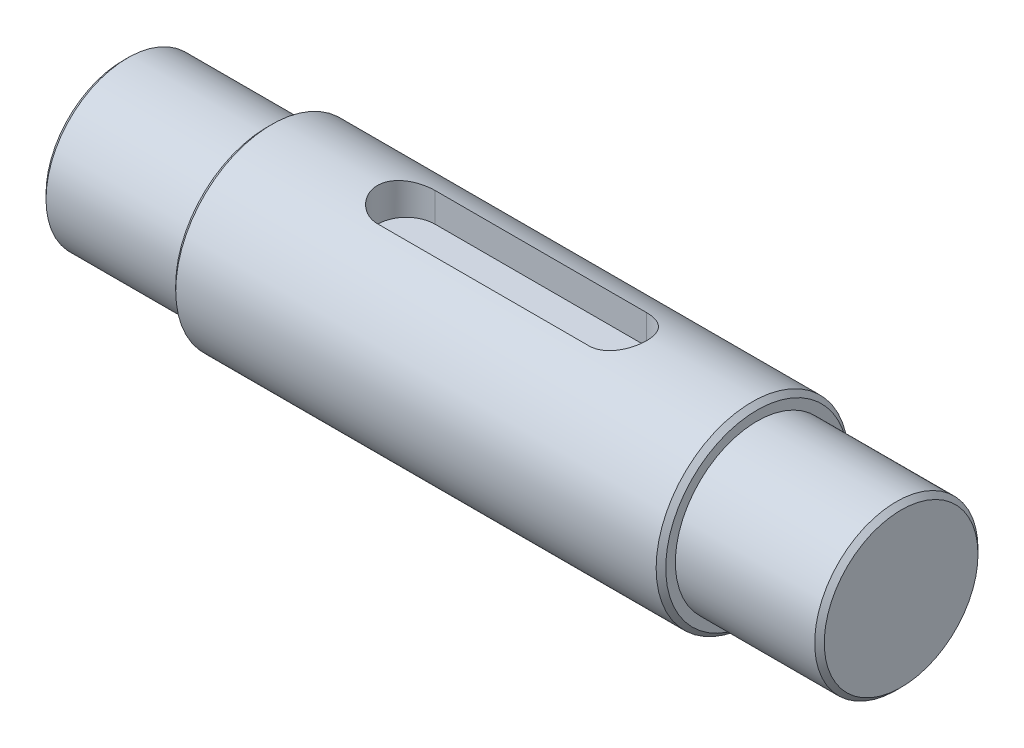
ISO-10303-21;
HEADER;
FILE_DESCRIPTION(('STEP AP214'),'2;1');
FILE_NAME('part.step','',(''),(''),'','','');
FILE_SCHEMA(('AUTOMOTIVE_DESIGN { 1 0 10303 214 1 1 1 1 }'));
ENDSEC;
DATA;
#1=APPLICATION_CONTEXT('core data for automotive mechanical design processes');
#2=APPLICATION_PROTOCOL_DEFINITION('international standard','automotive_design',2000,#1);
#3=PRODUCT_CONTEXT('',#1,'mechanical');
#4=PRODUCT('Part','Part','',(#3));
#5=PRODUCT_RELATED_PRODUCT_CATEGORY('part','',(#4));
#6=PRODUCT_DEFINITION_FORMATION('','',#4);
#7=PRODUCT_DEFINITION_CONTEXT('part definition',#1,'design');
#8=PRODUCT_DEFINITION('design','',#6,#7);
#9=PRODUCT_DEFINITION_SHAPE('','',#8);
#10=(LENGTH_UNIT() NAMED_UNIT(*) SI_UNIT(.MILLI.,.METRE.));
#11=(NAMED_UNIT(*) PLANE_ANGLE_UNIT() SI_UNIT($,.RADIAN.));
#12=(NAMED_UNIT(*) SI_UNIT($,.STERADIAN.) SOLID_ANGLE_UNIT());
#13=UNCERTAINTY_MEASURE_WITH_UNIT(LENGTH_MEASURE(1.E-05),#10,'distance_accuracy_value','');
#14=(GEOMETRIC_REPRESENTATION_CONTEXT(3) GLOBAL_UNCERTAINTY_ASSIGNED_CONTEXT((#13)) GLOBAL_UNIT_ASSIGNED_CONTEXT((#10,
#11,#12)) REPRESENTATION_CONTEXT('',''));
#15=CARTESIAN_POINT('',(0.,0.,0.));
#16=DIRECTION('',(0.,0.,1.));
#17=DIRECTION('',(1.,0.,0.));
#18=AXIS2_PLACEMENT_3D('',#15,#16,#17);
#19=CARTESIAN_POINT('',(66.,0.,0.));
#20=DIRECTION('',(-1.,0.,0.));
#21=DIRECTION('',(0.,0.,1.));
#22=AXIS2_PLACEMENT_3D('',#19,#20,#21);
#23=CYLINDRICAL_SURFACE('',#22,10.);
#24=CARTESIAN_POINT('',(51.5,9.53939201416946,3.));
#25=CARTESIAN_POINT('',(51.5823355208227,9.53938054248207,3.00001027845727));
#26=CARTESIAN_POINT('',(51.6646644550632,9.54045772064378,2.99661062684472));
#27=CARTESIAN_POINT('',(51.8286939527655,9.54470412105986,2.98307142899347));
#28=CARTESIAN_POINT('',(51.9103946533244,9.54787287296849,2.97293339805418));
#29=CARTESIAN_POINT('',(52.0723849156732,9.55620668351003,2.94603140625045));
#30=CARTESIAN_POINT('',(52.152677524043,9.56136667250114,2.92928426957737));
#31=CARTESIAN_POINT('',(52.3114758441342,9.57351626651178,2.88932853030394));
#32=CARTESIAN_POINT('',(52.3899815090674,9.58050591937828,2.8661197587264));
#33=CARTESIAN_POINT('',(52.6219493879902,9.60391637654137,2.78708584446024));
#34=CARTESIAN_POINT('',(52.772068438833,9.62279007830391,2.72181852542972));
#35=CARTESIAN_POINT('',(53.059226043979,9.66493213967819,2.56815043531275));
#36=CARTESIAN_POINT('',(53.1962584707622,9.68820254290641,2.47973889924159));
#37=CARTESIAN_POINT('',(53.4577229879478,9.73733650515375,2.27929879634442));
#38=CARTESIAN_POINT('',(53.5816848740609,9.76325505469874,2.16666914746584));
#39=CARTESIAN_POINT('',(53.8092736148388,9.81429628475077,1.92227736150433));
#40=CARTESIAN_POINT('',(53.912897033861,9.8394188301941,1.79051199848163));
#41=CARTESIAN_POINT('',(54.0989268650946,9.88666477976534,1.50821997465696));
#42=CARTESIAN_POINT('',(54.1808501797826,9.90871541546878,1.35736167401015));
#43=CARTESIAN_POINT('',(54.3179770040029,9.94668940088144,1.04324233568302));
#44=CARTESIAN_POINT('',(54.373187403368,9.96261433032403,0.879984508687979));
#45=CARTESIAN_POINT('',(54.453759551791,9.98615279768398,0.550649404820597));
#46=CARTESIAN_POINT('',(54.4799297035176,9.99399098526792,0.384786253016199));
#47=CARTESIAN_POINT('',(54.5042346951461,10.0012640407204,0.0508471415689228));
#48=CARTESIAN_POINT('',(54.5023748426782,10.0007004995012,-0.117228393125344));
#49=CARTESIAN_POINT('',(54.4712141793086,9.99139205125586,-0.44514319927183));
#50=CARTESIAN_POINT('',(54.4427893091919,9.98290831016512,-0.605074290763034));
#51=CARTESIAN_POINT('',(54.3607367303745,9.95903027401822,-0.917780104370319));
#52=CARTESIAN_POINT('',(54.3071077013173,9.94363561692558,-1.07055445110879));
#53=CARTESIAN_POINT('',(54.1755755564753,9.90730429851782,-1.36669563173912));
#54=CARTESIAN_POINT('',(54.0973967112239,9.88630511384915,-1.50993201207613));
#55=CARTESIAN_POINT('',(53.9192028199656,9.84099249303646,-1.78153105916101));
#56=CARTESIAN_POINT('',(53.8191828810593,9.81667831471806,-1.90989038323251));
#57=CARTESIAN_POINT('',(53.5956160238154,9.7662334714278,-2.15330901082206));
#58=CARTESIAN_POINT('',(53.4713122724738,9.74006890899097,-2.26766702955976));
#59=CARTESIAN_POINT('',(53.2050051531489,9.68968430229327,-2.47413538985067));
#60=CARTESIAN_POINT('',(53.0629966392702,9.66546482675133,-2.5662392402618));
#61=CARTESIAN_POINT('',(52.7634381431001,9.62154457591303,-2.72632814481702));
#62=CARTESIAN_POINT('',(52.6057456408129,9.60189192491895,-2.79406012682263));
#63=CARTESIAN_POINT('',(52.2805509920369,9.56991327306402,-2.90171772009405));
#64=CARTESIAN_POINT('',(52.1130642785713,9.55757606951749,-2.94168586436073));
#65=CARTESIAN_POINT('',(51.8700102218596,9.54628064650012,-2.97802407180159));
#66=CARTESIAN_POINT('',(51.7962185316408,9.54370312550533,-2.98626405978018));
#67=CARTESIAN_POINT('',(51.648297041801,9.54025857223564,-2.99724711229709));
#68=CARTESIAN_POINT('',(51.5741679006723,9.53938902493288,-2.99999825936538));
#69=CARTESIAN_POINT('',(51.5,9.53939201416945,-3.));
#70=B_SPLINE_CURVE_WITH_KNOTS('',3,(#24,#25,#26,#27,#28,#29,#30,#31,#32,#33,#34,#35,#36,#37,#38,
#39,#40,#41,#42,#43,#44,#45,#46,#47,#48,#49,#50,#51,#52,#53,#54,#55,#56,#57,#58,#59,#60,#61,#62,
#63,#64,#65,#66,#67,#68,#69),.UNSPECIFIED.,.F.,.F.,(4,2,2,2,2,2,2,2,2,2,2,2,2,2,2,2,2,2,2,2,2,2,
4),(0.,0.246918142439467,0.493780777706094,0.740019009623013,0.986263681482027,1.47813347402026,
1.97023245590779,2.47635119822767,2.98255536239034,3.49922810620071,4.01576751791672,
4.51753600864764,5.01920948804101,5.50490358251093,5.99062312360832,6.48200583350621,
6.9734987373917,7.48389234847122,7.99443465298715,8.51013494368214,9.02504345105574,
9.24774267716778,9.47011372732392),.UNSPECIFIED.);
#71=CARTESIAN_POINT('',(51.5,9.53939201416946,3.));
#72=VERTEX_POINT('',#71);
#73=CARTESIAN_POINT('',(51.5,9.53939201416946,-3.));
#74=VERTEX_POINT('',#73);
#75=EDGE_CURVE('E11',#72,#74,#70,.T.);
#76=ORIENTED_EDGE('',*,*,#75,.F.);
#77=DIRECTION('',(-1.,0.,0.));
#78=VECTOR('',#77,1.);
#79=CARTESIAN_POINT('',(66.,9.53939201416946,3.));
#80=LINE('',#79,#78);
#81=CARTESIAN_POINT('',(29.5,9.53939201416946,3.));
#82=VERTEX_POINT('',#81);
#83=EDGE_CURVE('E90',#82,#72,#80,.F.);
#84=ORIENTED_EDGE('',*,*,#83,.F.);
#85=CARTESIAN_POINT('',(29.5,9.53939201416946,-3.));
#86=CARTESIAN_POINT('',(29.4176644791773,9.53938054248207,-3.00001027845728));
#87=CARTESIAN_POINT('',(29.3353355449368,9.54045772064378,-2.99661062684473));
#88=CARTESIAN_POINT('',(29.1713060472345,9.54470412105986,-2.98307142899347));
#89=CARTESIAN_POINT('',(29.0896053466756,9.54787287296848,-2.97293339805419));
#90=CARTESIAN_POINT('',(28.9276150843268,9.55620668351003,-2.94603140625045));
#91=CARTESIAN_POINT('',(28.847322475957,9.56136667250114,-2.92928426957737));
#92=CARTESIAN_POINT('',(28.6885241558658,9.57351626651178,-2.88932853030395));
#93=CARTESIAN_POINT('',(28.6100184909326,9.58050591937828,-2.86611975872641));
#94=CARTESIAN_POINT('',(28.3780506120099,9.60391637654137,-2.78708584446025));
#95=CARTESIAN_POINT('',(28.227931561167,9.62279007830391,-2.72181852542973));
#96=CARTESIAN_POINT('',(27.940773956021,9.66493213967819,-2.56815043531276));
#97=CARTESIAN_POINT('',(27.8037415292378,9.68820254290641,-2.4797388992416));
#98=CARTESIAN_POINT('',(27.5422770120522,9.73733650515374,-2.27929879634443));
#99=CARTESIAN_POINT('',(27.4183151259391,9.76325505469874,-2.16666914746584));
#100=CARTESIAN_POINT('',(27.1907263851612,9.81429628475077,-1.92227736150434));
#101=CARTESIAN_POINT('',(27.087102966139,9.8394188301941,-1.79051199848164));
#102=CARTESIAN_POINT('',(26.9010731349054,9.88666477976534,-1.50821997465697));
#103=CARTESIAN_POINT('',(26.8191498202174,9.90871541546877,-1.35736167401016));
#104=CARTESIAN_POINT('',(26.6820229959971,9.94668940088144,-1.04324233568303));
#105=CARTESIAN_POINT('',(26.6268125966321,9.96261433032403,-0.87998450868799));
#106=CARTESIAN_POINT('',(26.546240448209,9.98615279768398,-0.550649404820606));
#107=CARTESIAN_POINT('',(26.5200702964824,9.99399098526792,-0.384786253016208));
#108=CARTESIAN_POINT('',(26.495765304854,10.0012640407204,-0.0508471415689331));
#109=CARTESIAN_POINT('',(26.4976251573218,10.0007004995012,0.117228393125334));
#110=CARTESIAN_POINT('',(26.5287858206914,9.99139205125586,0.445143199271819));
#111=CARTESIAN_POINT('',(26.5572106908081,9.98290831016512,0.605074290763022));
#112=CARTESIAN_POINT('',(26.6392632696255,9.95903027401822,0.917780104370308));
#113=CARTESIAN_POINT('',(26.6928922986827,9.94363561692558,1.07055445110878));
#114=CARTESIAN_POINT('',(26.8244244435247,9.90730429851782,1.36669563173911));
#115=CARTESIAN_POINT('',(26.9026032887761,9.88630511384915,1.50993201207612));
#116=CARTESIAN_POINT('',(27.0807971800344,9.84099249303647,1.781531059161));
#117=CARTESIAN_POINT('',(27.1808171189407,9.81667831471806,1.9098903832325));
#118=CARTESIAN_POINT('',(27.4043839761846,9.7662334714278,2.15330901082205));
#119=CARTESIAN_POINT('',(27.5286877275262,9.74006890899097,2.26766702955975));
#120=CARTESIAN_POINT('',(27.7949948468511,9.68968430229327,2.47413538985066));
#121=CARTESIAN_POINT('',(27.9370033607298,9.66546482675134,2.5662392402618));
#122=CARTESIAN_POINT('',(28.2365618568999,9.62154457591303,2.72632814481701));
#123=CARTESIAN_POINT('',(28.3942543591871,9.60189192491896,2.79406012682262));
#124=CARTESIAN_POINT('',(28.7194490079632,9.56991327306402,2.90171772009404));
#125=CARTESIAN_POINT('',(28.8869357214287,9.55757606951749,2.94168586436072));
#126=CARTESIAN_POINT('',(29.1299897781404,9.54628064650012,2.97802407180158));
#127=CARTESIAN_POINT('',(29.2037814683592,9.54370312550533,2.98626405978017));
#128=CARTESIAN_POINT('',(29.351702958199,9.54025857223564,2.99724711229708));
#129=CARTESIAN_POINT('',(29.4258320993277,9.53938902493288,2.99999825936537));
#130=CARTESIAN_POINT('',(29.5,9.53939201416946,3.));
#131=B_SPLINE_CURVE_WITH_KNOTS('',3,(#85,#86,#87,#88,#89,#90,#91,#92,#93,#94,#95,#96,#97,#98,
#99,#100,#101,#102,#103,#104,#105,#106,#107,#108,#109,#110,#111,#112,#113,#114,#115,#116,#117,
#118,#119,#120,#121,#122,#123,#124,#125,#126,#127,#128,#129,#130),.UNSPECIFIED.,.F.,.F.,(4,2,2,
2,2,2,2,2,2,2,2,2,2,2,2,2,2,2,2,2,2,2,4),(0.,0.246918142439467,0.493780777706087,
0.740019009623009,0.986263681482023,1.47813347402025,1.97023245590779,2.47635119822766,
2.98255536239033,3.4992281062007,4.01576751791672,4.51753600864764,5.019209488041,
5.50490358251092,5.99062312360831,6.48200583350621,6.97349873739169,7.48389234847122,
7.99443465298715,8.51013494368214,9.02504345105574,9.24774267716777,9.47011372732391),.UNSPECIFIED.);
#132=CARTESIAN_POINT('',(29.5,9.53939201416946,-3.));
#133=VERTEX_POINT('',#132);
#134=EDGE_CURVE('E164',#133,#82,#131,.T.);
#135=ORIENTED_EDGE('',*,*,#134,.F.);
#136=DIRECTION('',(-1.,0.,0.));
#137=VECTOR('',#136,1.);
#138=CARTESIAN_POINT('',(66.,9.53939201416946,-3.));
#139=LINE('',#138,#137);
#140=EDGE_CURVE('E56',#74,#133,#139,.T.);
#141=ORIENTED_EDGE('',*,*,#140,.F.);
#142=EDGE_LOOP('',(#76,#84,#135,#141));
#143=FACE_BOUND('',#142,.T.);
#144=CARTESIAN_POINT('',(65.5,0.,0.));
#145=DIRECTION('',(1.,0.,0.));
#146=DIRECTION('',(0.,0.,-1.));
#147=AXIS2_PLACEMENT_3D('',#144,#145,#146);
#148=CIRCLE('',#147,10.);
#149=CARTESIAN_POINT('',(65.5,0.,-10.));
#150=VERTEX_POINT('',#149);
#151=EDGE_CURVE('E134',#150,#150,#148,.F.);
#152=ORIENTED_EDGE('',*,*,#151,.T.);
#153=EDGE_LOOP('',(#152));
#154=FACE_BOUND('',#153,.T.);
#155=CARTESIAN_POINT('',(15.5,0.,0.));
#156=DIRECTION('',(-1.,0.,0.));
#157=DIRECTION('',(0.,0.,1.));
#158=AXIS2_PLACEMENT_3D('',#155,#156,#157);
#159=CIRCLE('',#158,10.);
#160=CARTESIAN_POINT('',(15.5,0.,10.));
#161=VERTEX_POINT('',#160);
#162=EDGE_CURVE('E127',#161,#161,#159,.F.);
#163=ORIENTED_EDGE('',*,*,#162,.T.);
#164=EDGE_LOOP('',(#163));
#165=FACE_BOUND('',#164,.T.);
#166=ADVANCED_FACE('F41',(#143,#154,#165),#23,.T.);
#167=CARTESIAN_POINT('',(66.,10.,0.));
#168=DIRECTION('',(1.,0.,0.));
#169=DIRECTION('',(0.,0.,-1.));
#170=AXIS2_PLACEMENT_3D('',#167,#168,#169);
#171=PLANE('',#170);
#172=CARTESIAN_POINT('',(66.,0.,0.));
#173=DIRECTION('',(1.,0.,0.));
#174=DIRECTION('',(0.,0.,-1.));
#175=AXIS2_PLACEMENT_3D('',#172,#173,#174);
#176=CIRCLE('',#175,9.50000000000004);
#177=CARTESIAN_POINT('',(66.,0.,-9.50000000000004));
#178=VERTEX_POINT('',#177);
#179=EDGE_CURVE('E138',#178,#178,#176,.T.);
#180=ORIENTED_EDGE('',*,*,#179,.T.);
#181=EDGE_LOOP('',(#180));
#182=FACE_BOUND('',#181,.T.);
#183=CARTESIAN_POINT('',(66.,0.,0.));
#184=DIRECTION('',(1.,0.,0.));
#185=DIRECTION('',(0.,0.,-1.));
#186=AXIS2_PLACEMENT_3D('',#183,#184,#185);
#187=CIRCLE('',#186,8.5);
#188=CARTESIAN_POINT('',(66.,0.,-8.5));
#189=VERTEX_POINT('',#188);
#190=EDGE_CURVE('E123',#189,#189,#187,.T.);
#191=ORIENTED_EDGE('',*,*,#190,.F.);
#192=EDGE_LOOP('',(#191));
#193=FACE_BOUND('',#192,.T.);
#194=ADVANCED_FACE('F205',(#182,#193),#171,.T.);
#195=CARTESIAN_POINT('',(15.,0.,0.));
#196=DIRECTION('',(-1.,0.,0.));
#197=DIRECTION('',(0.,0.,1.));
#198=AXIS2_PLACEMENT_3D('',#195,#196,#197);
#199=PLANE('',#198);
#200=CARTESIAN_POINT('',(15.,0.,0.));
#201=DIRECTION('',(-1.,0.,0.));
#202=DIRECTION('',(0.,0.,1.));
#203=AXIS2_PLACEMENT_3D('',#200,#201,#202);
#204=CIRCLE('',#203,9.5);
#205=CARTESIAN_POINT('',(15.,0.,9.5));
#206=VERTEX_POINT('',#205);
#207=EDGE_CURVE('E142',#206,#206,#204,.T.);
#208=ORIENTED_EDGE('',*,*,#207,.T.);
#209=EDGE_LOOP('',(#208));
#210=FACE_BOUND('',#209,.T.);
#211=CARTESIAN_POINT('',(15.,0.,0.));
#212=DIRECTION('',(-1.,0.,0.));
#213=DIRECTION('',(0.,0.,1.));
#214=AXIS2_PLACEMENT_3D('',#211,#212,#213);
#215=CIRCLE('',#214,8.5);
#216=CARTESIAN_POINT('',(15.,0.,8.5));
#217=VERTEX_POINT('',#216);
#218=EDGE_CURVE('E117',#217,#217,#215,.T.);
#219=ORIENTED_EDGE('',*,*,#218,.F.);
#220=EDGE_LOOP('',(#219));
#221=FACE_BOUND('',#220,.T.);
#222=ADVANCED_FACE('F202',(#210,#221),#199,.T.);
#223=CARTESIAN_POINT('',(0.,0.,0.));
#224=DIRECTION('',(1.,0.,0.));
#225=DIRECTION('',(0.,0.,-1.));
#226=AXIS2_PLACEMENT_3D('',#223,#224,#225);
#227=CYLINDRICAL_SURFACE('',#226,8.5);
#228=CARTESIAN_POINT('',(0.499999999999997,0.,0.));
#229=DIRECTION('',(-1.,0.,0.));
#230=DIRECTION('',(0.,0.,1.));
#231=AXIS2_PLACEMENT_3D('',#228,#229,#230);
#232=CIRCLE('',#231,8.5);
#233=CARTESIAN_POINT('',(0.499999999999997,0.,8.5));
#234=VERTEX_POINT('',#233);
#235=EDGE_CURVE('E150',#234,#234,#232,.F.);
#236=ORIENTED_EDGE('',*,*,#235,.T.);
#237=EDGE_LOOP('',(#236));
#238=FACE_BOUND('',#237,.T.);
#239=ORIENTED_EDGE('',*,*,#218,.T.);
#240=EDGE_LOOP('',(#239));
#241=FACE_BOUND('',#240,.T.);
#242=ADVANCED_FACE('F198',(#238,#241),#227,.T.);
#243=CARTESIAN_POINT('',(0.,0.,0.));
#244=DIRECTION('',(-1.,0.,0.));
#245=DIRECTION('',(0.,0.,1.));
#246=AXIS2_PLACEMENT_3D('',#243,#244,#245);
#247=PLANE('',#246);
#248=CARTESIAN_POINT('',(0.,0.,0.));
#249=DIRECTION('',(-1.,0.,0.));
#250=DIRECTION('',(0.,0.,1.));
#251=AXIS2_PLACEMENT_3D('',#248,#249,#250);
#252=CIRCLE('',#251,8.);
#253=CARTESIAN_POINT('',(0.,0.,8.));
#254=VERTEX_POINT('',#253);
#255=EDGE_CURVE('E146',#254,#254,#252,.T.);
#256=ORIENTED_EDGE('',*,*,#255,.T.);
#257=EDGE_LOOP('',(#256));
#258=FACE_BOUND('',#257,.T.);
#259=ADVANCED_FACE('F194',(#258),#247,.T.);
#260=CARTESIAN_POINT('',(81.,0.,0.));
#261=DIRECTION('',(-1.,0.,0.));
#262=DIRECTION('',(0.,0.,1.));
#263=AXIS2_PLACEMENT_3D('',#260,#261,#262);
#264=CYLINDRICAL_SURFACE('',#263,8.5);
#265=CARTESIAN_POINT('',(80.5,0.,0.));
#266=DIRECTION('',(1.,0.,0.));
#267=DIRECTION('',(0.,0.,-1.));
#268=AXIS2_PLACEMENT_3D('',#265,#266,#267);
#269=CIRCLE('',#268,8.5);
#270=CARTESIAN_POINT('',(80.5,0.,-8.5));
#271=VERTEX_POINT('',#270);
#272=EDGE_CURVE('E158',#271,#271,#269,.F.);
#273=ORIENTED_EDGE('',*,*,#272,.T.);
#274=EDGE_LOOP('',(#273));
#275=FACE_BOUND('',#274,.T.);
#276=ORIENTED_EDGE('',*,*,#190,.T.);
#277=EDGE_LOOP('',(#276));
#278=FACE_BOUND('',#277,.T.);
#279=ADVANCED_FACE('F190',(#275,#278),#264,.T.);
#280=CARTESIAN_POINT('',(81.,0.,0.));
#281=DIRECTION('',(1.,0.,0.));
#282=DIRECTION('',(0.,0.,-1.));
#283=AXIS2_PLACEMENT_3D('',#280,#281,#282);
#284=PLANE('',#283);
#285=CARTESIAN_POINT('',(81.,0.,0.));
#286=DIRECTION('',(1.,0.,0.));
#287=DIRECTION('',(0.,0.,-1.));
#288=AXIS2_PLACEMENT_3D('',#285,#286,#287);
#289=CIRCLE('',#288,8.);
#290=CARTESIAN_POINT('',(81.,0.,-8.));
#291=VERTEX_POINT('',#290);
#292=EDGE_CURVE('E154',#291,#291,#289,.T.);
#293=ORIENTED_EDGE('',*,*,#292,.T.);
#294=EDGE_LOOP('',(#293));
#295=FACE_BOUND('',#294,.T.);
#296=ADVANCED_FACE('F186',(#295),#284,.T.);
#297=CARTESIAN_POINT('',(65.5,0.,0.));
#298=DIRECTION('',(-1.,0.,0.));
#299=DIRECTION('',(0.,0.,1.));
#300=AXIS2_PLACEMENT_3D('',#297,#298,#299);
#301=CONICAL_SURFACE('',#300,10.,0.785398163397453);
#302=ORIENTED_EDGE('',*,*,#179,.F.);
#303=EDGE_LOOP('',(#302));
#304=FACE_BOUND('',#303,.T.);
#305=ORIENTED_EDGE('',*,*,#151,.F.);
#306=EDGE_LOOP('',(#305));
#307=FACE_BOUND('',#306,.T.);
#308=ADVANCED_FACE('F189',(#304,#307),#301,.T.);
#309=CARTESIAN_POINT('',(15.,0.,0.));
#310=DIRECTION('',(1.,0.,0.));
#311=DIRECTION('',(0.,0.,-1.));
#312=AXIS2_PLACEMENT_3D('',#309,#310,#311);
#313=CONICAL_SURFACE('',#312,9.5,0.78539816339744);
#314=ORIENTED_EDGE('',*,*,#162,.F.);
#315=EDGE_LOOP('',(#314));
#316=FACE_BOUND('',#315,.T.);
#317=ORIENTED_EDGE('',*,*,#207,.F.);
#318=EDGE_LOOP('',(#317));
#319=FACE_BOUND('',#318,.T.);
#320=ADVANCED_FACE('F220',(#316,#319),#313,.T.);
#321=CARTESIAN_POINT('',(0.,0.,0.));
#322=DIRECTION('',(1.,0.,0.));
#323=DIRECTION('',(0.,0.,-1.));
#324=AXIS2_PLACEMENT_3D('',#321,#322,#323);
#325=CONICAL_SURFACE('',#324,8.,0.785398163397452);
#326=ORIENTED_EDGE('',*,*,#235,.F.);
#327=EDGE_LOOP('',(#326));
#328=FACE_BOUND('',#327,.T.);
#329=ORIENTED_EDGE('',*,*,#255,.F.);
#330=EDGE_LOOP('',(#329));
#331=FACE_BOUND('',#330,.T.);
#332=ADVANCED_FACE('F228',(#328,#331),#325,.T.);
#333=CARTESIAN_POINT('',(81.,0.,0.));
#334=DIRECTION('',(-1.,0.,0.));
#335=DIRECTION('',(0.,0.,1.));
#336=AXIS2_PLACEMENT_3D('',#333,#334,#335);
#337=CONICAL_SURFACE('',#336,8.,0.785398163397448);
#338=ORIENTED_EDGE('',*,*,#272,.F.);
#339=EDGE_LOOP('',(#338));
#340=FACE_BOUND('',#339,.T.);
#341=ORIENTED_EDGE('',*,*,#292,.F.);
#342=EDGE_LOOP('',(#341));
#343=FACE_BOUND('',#342,.T.);
#344=ADVANCED_FACE('F43',(#340,#343),#337,.T.);
#345=CARTESIAN_POINT('',(51.5,16.5,0.));
#346=DIRECTION('',(0.,-1.,0.));
#347=DIRECTION('',(0.,0.,-1.));
#348=AXIS2_PLACEMENT_3D('',#345,#346,#347);
#349=CYLINDRICAL_SURFACE('',#348,3.);
#350=ORIENTED_EDGE('',*,*,#75,.T.);
#351=DIRECTION('',(0.,-1.,0.));
#352=VECTOR('',#351,1.);
#353=CARTESIAN_POINT('',(51.5,16.5,-3.));
#354=LINE('',#353,#352);
#355=CARTESIAN_POINT('',(51.5,6.50000000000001,-3.));
#356=VERTEX_POINT('',#355);
#357=EDGE_CURVE('E107',#74,#356,#354,.T.);
#358=ORIENTED_EDGE('',*,*,#357,.T.);
#359=CARTESIAN_POINT('',(51.5,6.50000000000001,0.));
#360=DIRECTION('',(0.,-1.,0.));
#361=DIRECTION('',(0.,0.,-1.));
#362=AXIS2_PLACEMENT_3D('',#359,#360,#361);
#363=CIRCLE('',#362,3.);
#364=CARTESIAN_POINT('',(51.5,6.50000000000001,3.));
#365=VERTEX_POINT('',#364);
#366=EDGE_CURVE('E100',#356,#365,#363,.T.);
#367=ORIENTED_EDGE('',*,*,#366,.T.);
#368=DIRECTION('',(0.,-1.,0.));
#369=VECTOR('',#368,1.);
#370=CARTESIAN_POINT('',(51.5,16.5,3.));
#371=LINE('',#370,#369);
#372=EDGE_CURVE('E85',#72,#365,#371,.T.);
#373=ORIENTED_EDGE('',*,*,#372,.F.);
#374=EDGE_LOOP('',(#350,#358,#367,#373));
#375=FACE_BOUND('',#374,.T.);
#376=ADVANCED_FACE('F106',(#375),#349,.F.);
#377=CARTESIAN_POINT('',(29.5,16.5,-3.));
#378=DIRECTION('',(0.,0.,-1.));
#379=DIRECTION('',(0.,1.,0.));
#380=AXIS2_PLACEMENT_3D('',#377,#378,#379);
#381=PLANE('',#380);
#382=ORIENTED_EDGE('',*,*,#140,.T.);
#383=DIRECTION('',(0.,-1.,0.));
#384=VECTOR('',#383,1.);
#385=CARTESIAN_POINT('',(29.5,16.5,-3.));
#386=LINE('',#385,#384);
#387=CARTESIAN_POINT('',(29.5,6.50000000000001,-3.));
#388=VERTEX_POINT('',#387);
#389=EDGE_CURVE('E118',#133,#388,#386,.T.);
#390=ORIENTED_EDGE('',*,*,#389,.T.);
#391=DIRECTION('',(1.,0.,0.));
#392=VECTOR('',#391,1.);
#393=CARTESIAN_POINT('',(29.5,6.50000000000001,-3.));
#394=LINE('',#393,#392);
#395=EDGE_CURVE('E93',#388,#356,#394,.T.);
#396=ORIENTED_EDGE('',*,*,#395,.T.);
#397=ORIENTED_EDGE('',*,*,#357,.F.);
#398=EDGE_LOOP('',(#382,#390,#396,#397));
#399=FACE_BOUND('',#398,.T.);
#400=ADVANCED_FACE('F179',(#399),#381,.F.);
#401=CARTESIAN_POINT('',(29.5,16.5,0.));
#402=DIRECTION('',(0.,-1.,0.));
#403=DIRECTION('',(0.,0.,-1.));
#404=AXIS2_PLACEMENT_3D('',#401,#402,#403);
#405=CYLINDRICAL_SURFACE('',#404,3.);
#406=ORIENTED_EDGE('',*,*,#134,.T.);
#407=DIRECTION('',(0.,-1.,0.));
#408=VECTOR('',#407,1.);
#409=CARTESIAN_POINT('',(29.5,16.5,2.99999999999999));
#410=LINE('',#409,#408);
#411=CARTESIAN_POINT('',(29.5,6.50000000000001,3.));
#412=VERTEX_POINT('',#411);
#413=EDGE_CURVE('E63',#82,#412,#410,.T.);
#414=ORIENTED_EDGE('',*,*,#413,.T.);
#415=CARTESIAN_POINT('',(29.5,6.50000000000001,0.));
#416=DIRECTION('',(0.,-1.,0.));
#417=DIRECTION('',(0.,0.,-1.));
#418=AXIS2_PLACEMENT_3D('',#415,#416,#417);
#419=CIRCLE('',#418,3.);
#420=EDGE_CURVE('E103',#412,#388,#419,.T.);
#421=ORIENTED_EDGE('',*,*,#420,.T.);
#422=ORIENTED_EDGE('',*,*,#389,.F.);
#423=EDGE_LOOP('',(#406,#414,#421,#422));
#424=FACE_BOUND('',#423,.T.);
#425=ADVANCED_FACE('F174',(#424),#405,.F.);
#426=CARTESIAN_POINT('',(51.5,16.5,3.));
#427=DIRECTION('',(0.,0.,1.));
#428=DIRECTION('',(0.,-1.,0.));
#429=AXIS2_PLACEMENT_3D('',#426,#427,#428);
#430=PLANE('',#429);
#431=ORIENTED_EDGE('',*,*,#83,.T.);
#432=ORIENTED_EDGE('',*,*,#372,.T.);
#433=DIRECTION('',(-1.,0.,0.));
#434=VECTOR('',#433,1.);
#435=CARTESIAN_POINT('',(51.5,6.50000000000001,3.));
#436=LINE('',#435,#434);
#437=EDGE_CURVE('E88',#365,#412,#436,.T.);
#438=ORIENTED_EDGE('',*,*,#437,.T.);
#439=ORIENTED_EDGE('',*,*,#413,.F.);
#440=EDGE_LOOP('',(#431,#432,#438,#439));
#441=FACE_BOUND('',#440,.T.);
#442=ADVANCED_FACE('F87',(#441),#430,.F.);
#443=CARTESIAN_POINT('',(51.5,6.50000000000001,0.));
#444=DIRECTION('',(0.,-1.,0.));
#445=DIRECTION('',(0.,0.,-1.));
#446=AXIS2_PLACEMENT_3D('',#443,#444,#445);
#447=PLANE('',#446);
#448=ORIENTED_EDGE('',*,*,#366,.F.);
#449=ORIENTED_EDGE('',*,*,#395,.F.);
#450=ORIENTED_EDGE('',*,*,#420,.F.);
#451=ORIENTED_EDGE('',*,*,#437,.F.);
#452=EDGE_LOOP('',(#448,#449,#450,#451));
#453=FACE_BOUND('',#452,.T.);
#454=ADVANCED_FACE('F98',(#453),#447,.F.);
#455=CLOSED_SHELL('',(#166,#194,#222,#242,#259,#279,#296,#308,#320,#332,#344,#376,#400,#425,
#442,#454));
#456=MANIFOLD_SOLID_BREP('B2',#455);
#457=ADVANCED_BREP_SHAPE_REPRESENTATION('',(#18,#456),#14);
#458=SHAPE_DEFINITION_REPRESENTATION(#9,#457);
ENDSEC;
END-ISO-10303-21;
